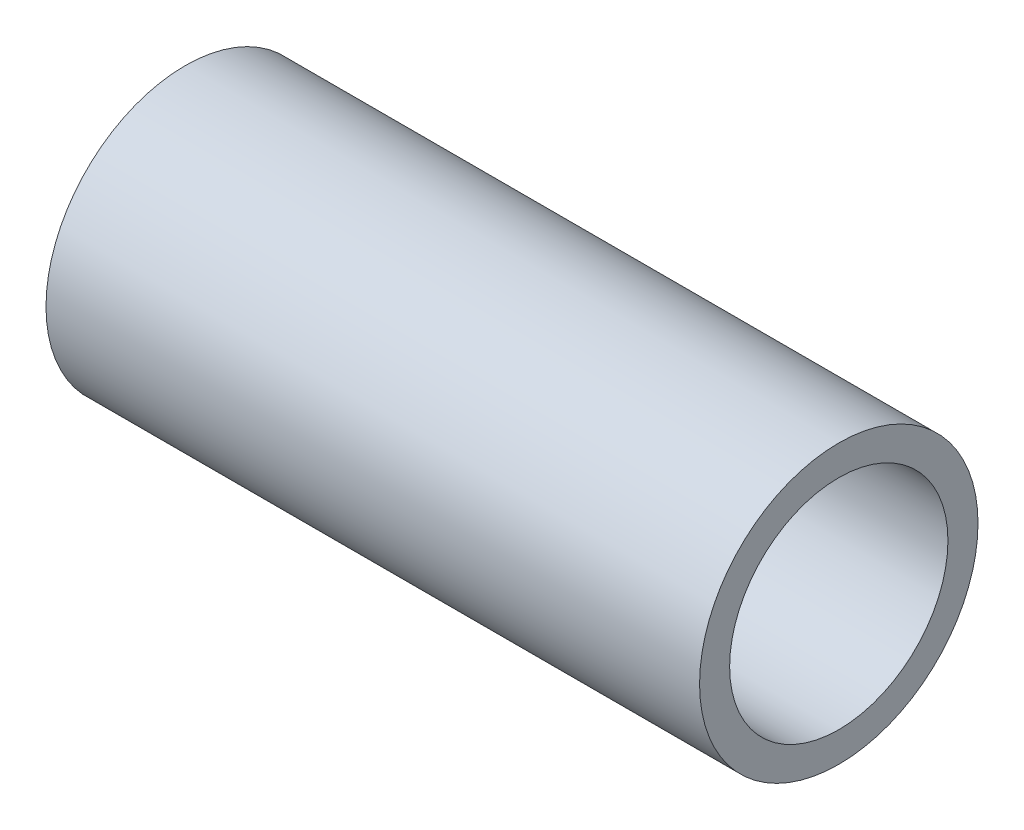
ISO-10303-21;
HEADER;
FILE_DESCRIPTION(('STEP AP214'),'2;1');
FILE_NAME('part.step','',(''),(''),'','','');
FILE_SCHEMA(('AUTOMOTIVE_DESIGN { 1 0 10303 214 1 1 1 1 }'));
ENDSEC;
DATA;
#1=APPLICATION_CONTEXT('core data for automotive mechanical design processes');
#2=APPLICATION_PROTOCOL_DEFINITION('international standard','automotive_design',2000,#1);
#3=PRODUCT_CONTEXT('',#1,'mechanical');
#4=PRODUCT('Part','Part','',(#3));
#5=PRODUCT_RELATED_PRODUCT_CATEGORY('part','',(#4));
#6=PRODUCT_DEFINITION_FORMATION('','',#4);
#7=PRODUCT_DEFINITION_CONTEXT('part definition',#1,'design');
#8=PRODUCT_DEFINITION('design','',#6,#7);
#9=PRODUCT_DEFINITION_SHAPE('','',#8);
#10=(LENGTH_UNIT() NAMED_UNIT(*) SI_UNIT(.MILLI.,.METRE.));
#11=(NAMED_UNIT(*) PLANE_ANGLE_UNIT() SI_UNIT($,.RADIAN.));
#12=(NAMED_UNIT(*) SI_UNIT($,.STERADIAN.) SOLID_ANGLE_UNIT());
#13=UNCERTAINTY_MEASURE_WITH_UNIT(LENGTH_MEASURE(1.E-05),#10,'distance_accuracy_value','');
#14=(GEOMETRIC_REPRESENTATION_CONTEXT(3) GLOBAL_UNCERTAINTY_ASSIGNED_CONTEXT((#13)) GLOBAL_UNIT_ASSIGNED_CONTEXT((#10,
#11,#12)) REPRESENTATION_CONTEXT('',''));
#15=CARTESIAN_POINT('',(0.,0.,0.));
#16=DIRECTION('',(0.,0.,1.));
#17=DIRECTION('',(1.,0.,0.));
#18=AXIS2_PLACEMENT_3D('',#15,#16,#17);
#19=CARTESIAN_POINT('',(50.,0.,0.));
#20=DIRECTION('',(-1.,0.,0.));
#21=DIRECTION('',(0.,0.,1.));
#22=AXIS2_PLACEMENT_3D('',#19,#20,#21);
#23=CYLINDRICAL_SURFACE('',#22,8.35);
#24=CARTESIAN_POINT('',(50.,0.,0.));
#25=DIRECTION('',(1.,0.,0.));
#26=DIRECTION('',(0.,0.,-1.));
#27=AXIS2_PLACEMENT_3D('',#24,#25,#26);
#28=CIRCLE('',#27,8.35);
#29=CARTESIAN_POINT('',(50.,0.,-8.35));
#30=VERTEX_POINT('',#29);
#31=EDGE_CURVE('E39',#30,#30,#28,.T.);
#32=ORIENTED_EDGE('',*,*,#31,.T.);
#33=EDGE_LOOP('',(#32));
#34=FACE_BOUND('',#33,.T.);
#35=CARTESIAN_POINT('',(0.,0.,0.));
#36=DIRECTION('',(1.,0.,0.));
#37=DIRECTION('',(0.,0.,-1.));
#38=AXIS2_PLACEMENT_3D('',#35,#36,#37);
#39=CIRCLE('',#38,8.35);
#40=CARTESIAN_POINT('',(0.,0.,-8.35));
#41=VERTEX_POINT('',#40);
#42=EDGE_CURVE('E45',#41,#41,#39,.T.);
#43=ORIENTED_EDGE('',*,*,#42,.F.);
#44=EDGE_LOOP('',(#43));
#45=FACE_BOUND('',#44,.T.);
#46=ADVANCED_FACE('F32',(#34,#45),#23,.F.);
#47=CARTESIAN_POINT('',(50.,0.,0.));
#48=DIRECTION('',(-1.,0.,0.));
#49=DIRECTION('',(0.,0.,1.));
#50=AXIS2_PLACEMENT_3D('',#47,#48,#49);
#51=CYLINDRICAL_SURFACE('',#50,10.65);
#52=CARTESIAN_POINT('',(50.,0.,0.));
#53=DIRECTION('',(1.,0.,0.));
#54=DIRECTION('',(0.,0.,-1.));
#55=AXIS2_PLACEMENT_3D('',#52,#53,#54);
#56=CIRCLE('',#55,10.65);
#57=CARTESIAN_POINT('',(50.,0.,-10.65));
#58=VERTEX_POINT('',#57);
#59=EDGE_CURVE('E10',#58,#58,#56,.T.);
#60=ORIENTED_EDGE('',*,*,#59,.F.);
#61=EDGE_LOOP('',(#60));
#62=FACE_BOUND('',#61,.T.);
#63=CARTESIAN_POINT('',(0.,0.,0.));
#64=DIRECTION('',(1.,0.,0.));
#65=DIRECTION('',(0.,0.,-1.));
#66=AXIS2_PLACEMENT_3D('',#63,#64,#65);
#67=CIRCLE('',#66,10.65);
#68=CARTESIAN_POINT('',(0.,0.,-10.65));
#69=VERTEX_POINT('',#68);
#70=EDGE_CURVE('E35',#69,#69,#67,.T.);
#71=ORIENTED_EDGE('',*,*,#70,.T.);
#72=EDGE_LOOP('',(#71));
#73=FACE_BOUND('',#72,.T.);
#74=ADVANCED_FACE('F52',(#62,#73),#51,.T.);
#75=CARTESIAN_POINT('',(50.,0.,0.));
#76=DIRECTION('',(1.,0.,0.));
#77=DIRECTION('',(0.,0.,-1.));
#78=AXIS2_PLACEMENT_3D('',#75,#76,#77);
#79=PLANE('',#78);
#80=ORIENTED_EDGE('',*,*,#31,.F.);
#81=EDGE_LOOP('',(#80));
#82=FACE_BOUND('',#81,.T.);
#83=ORIENTED_EDGE('',*,*,#59,.T.);
#84=EDGE_LOOP('',(#83));
#85=FACE_BOUND('',#84,.T.);
#86=ADVANCED_FACE('F56',(#82,#85),#79,.T.);
#87=CARTESIAN_POINT('',(0.,0.,0.));
#88=DIRECTION('',(1.,0.,0.));
#89=DIRECTION('',(0.,0.,-1.));
#90=AXIS2_PLACEMENT_3D('',#87,#88,#89);
#91=PLANE('',#90);
#92=ORIENTED_EDGE('',*,*,#42,.T.);
#93=EDGE_LOOP('',(#92));
#94=FACE_BOUND('',#93,.T.);
#95=ORIENTED_EDGE('',*,*,#70,.F.);
#96=EDGE_LOOP('',(#95));
#97=FACE_BOUND('',#96,.T.);
#98=ADVANCED_FACE('F54',(#94,#97),#91,.F.);
#99=CLOSED_SHELL('',(#46,#74,#86,#98));
#100=MANIFOLD_SOLID_BREP('B2',#99);
#101=ADVANCED_BREP_SHAPE_REPRESENTATION('',(#18,#100),#14);
#102=SHAPE_DEFINITION_REPRESENTATION(#9,#101);
ENDSEC;
END-ISO-10303-21;
